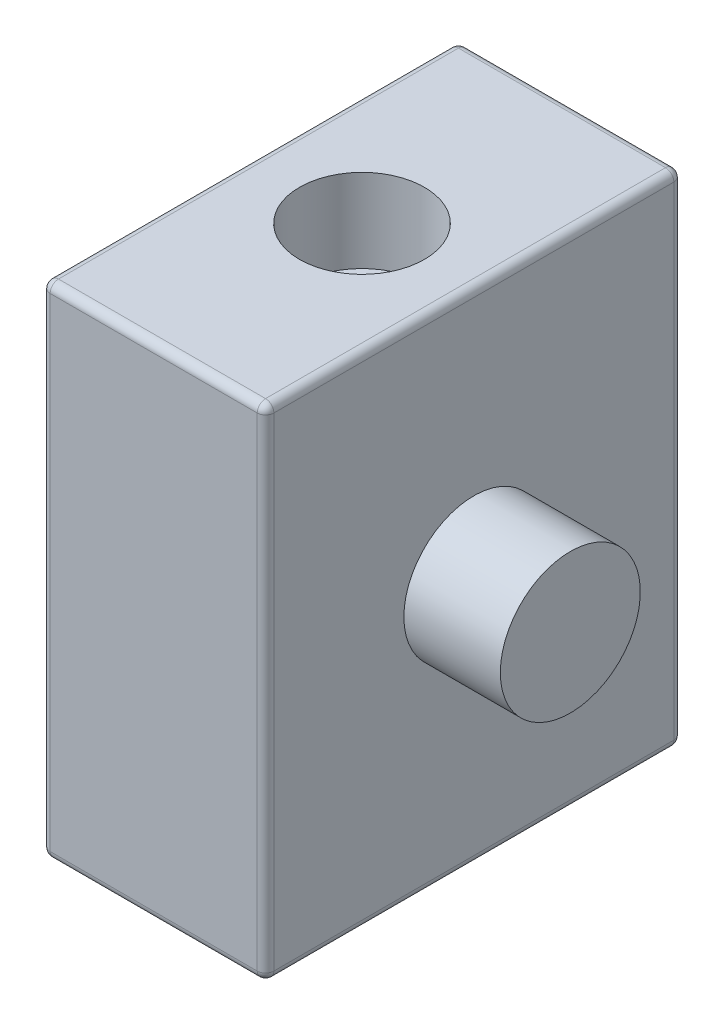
from build123d import *

# Parameters (mm, degrees)
SKETCH3_W           = 63.5
SKETCH3_H           = 76.2
BOSS_EXTRUDE1_DEPTH = 17.05
SKETCH4_R           = 10.668
BOSS_EXTRUDE2_DEPTH = 14.7
SKETCH5_R           = 9.525
CUT_EXTRUDE1_DEPTH  = 12.7
FILLET1_R           = 1.27


with BuildPart() as part:
    # Sketch3 → Boss-Extrude1 (new, symmetric)
    with BuildSketch(Plane(origin=(0, 0, 0), x_dir=(0, 0, -1), z_dir=(1, 0, 0))):
        Rectangle(SKETCH3_W, SKETCH3_H)
    extrude(amount=BOSS_EXTRUDE1_DEPTH, both=True)

    # Sketch4 → Boss-Extrude2 (add)
    with BuildSketch(Plane.ZY.offset(17.05)):
        Circle(SKETCH4_R)
    boss_extrude2 = extrude(amount=BOSS_EXTRUDE2_DEPTH)

    # Sketch5 → Cut-Extrude1 (cut)
    with BuildSketch(Plane(origin=(0, 38.1, 0), x_dir=(1, 0, 0), z_dir=(0, 1, 0))):
        with Locations(Location((0, 0, 0), (0, 0, 270))):
            Circle(SKETCH5_R)
    extrude(amount=-CUT_EXTRUDE1_DEPTH, mode=Mode.SUBTRACT)

    # Mirror1: Boss-Extrude2 across plane
    add(boss_extrude2.mirror(Plane(origin=(0, 0, 0), x_dir=(0, 0, 1), z_dir=(1, 0, 0))))

    # Fillet1
    fillet1_edges = [part.edges().sort_by_distance(p)[0] for p in [
        (0, 38.1, 31.75),
        (-17.05, 38.1, 0),
        (17.05, 38.1, 0),
        (0, 38.1, -31.75),
        (0, -38.1, 31.75),
        (-17.05, 0, 31.75),
        (17.05, 0, 31.75),
        (-17.05, 0, -31.75),
        (-17.05, -38.1, 0),
        (17.05, 0, -31.75),
        (17.05, -38.1, 0),
        (0, -38.1, -31.75),
    ]]
    fillet(fillet1_edges, radius=FILLET1_R)


solid = part.part
